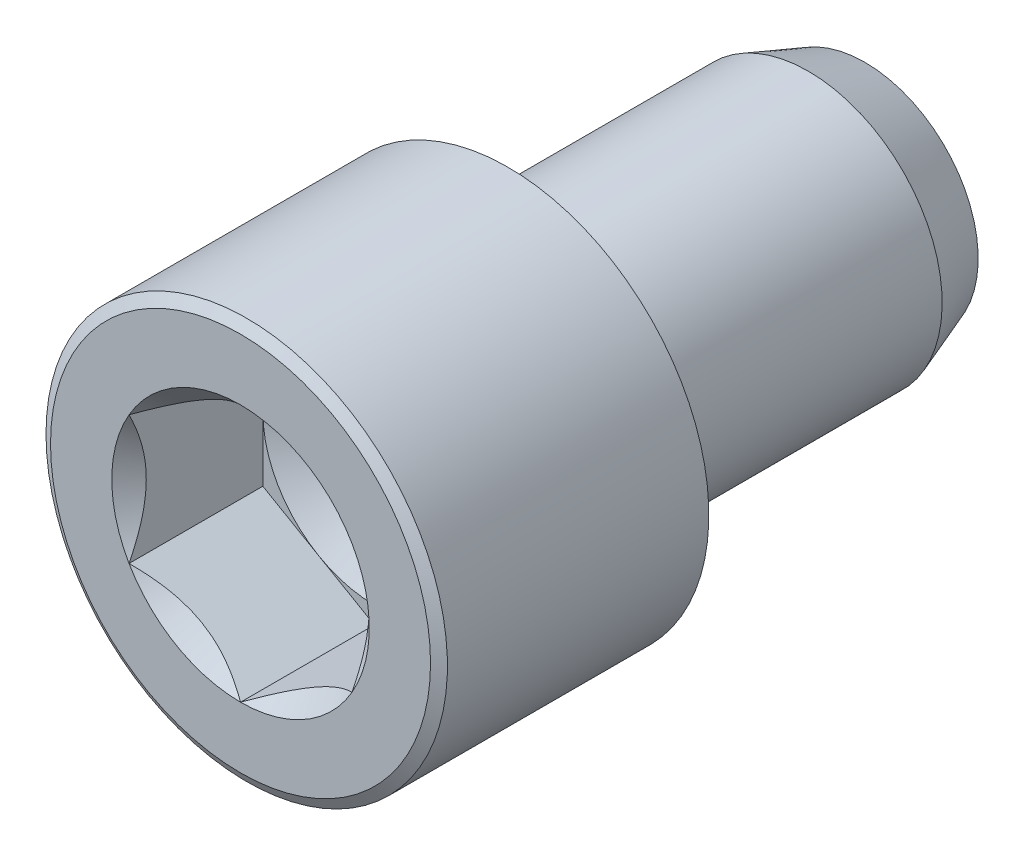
from build123d import *

# Parameters (mm, degrees)
SKETCH1_W          = 12.7
SKETCH1_H          = 4.7625
SKETCH4_R          = 7.14375
EXTRUDE1_DEPTH     = 9.525
CHAMFER1_SIZE      = 0.381
CHAMFER1_SIZE2     = 0.219970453
CUT_EXTRUDE1_DEPTH = 4.7625
SKETCH8_R          = 3.96875
CUT_EXTRUDE5_DEPTH = 1.5875
CUT_EXTRUDE5_DRAFT = -60


with BuildPart() as part:
    # Sketch1 → Revolve1 (revolve)
    with BuildSketch(Plane(origin=(0, 0, 0), x_dir=(0, 0, -1), z_dir=(1, 0, 0))):
        with Locations((6.35, 2.38125)):
            Rectangle(SKETCH1_W, SKETCH1_H)
    revolve(axis=Axis((0, 0, 0), (0, 0, 1)))

    # Sketch3 → Cut-Revolve2 (revolve, cut)
    with BuildSketch(Plane(origin=(0, 0, 0), x_dir=(0, 0, -1), z_dir=(1, 0, 0))):
        Polygon((12.7, 4.029111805), (10.685032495, 4.7625), (12.7, 4.7625), align=None)
    revolve(axis=Axis((0, 0, -10.685032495), (0, 0, 1)), mode=Mode.SUBTRACT)

    # Sketch4 → Extrude1 (add)
    with BuildSketch(Plane.XY):
        with Locations(Location((0, 0, 0), (0, 0, 180))):
            Circle(SKETCH4_R)
    extrude(amount=EXTRUDE1_DEPTH)

    # Chamfer1
    chamfer1_edges = [part.edges().sort_by_distance(p)[0] for p in [
        (7.14375, 0, 9.525),
    ]]
    chamfer1_side = [part.faces().sort_by_distance(p)[0] for p in [
        (0, 0, 9.525),
    ]]
    chamfer(chamfer1_edges, length=CHAMFER1_SIZE, length2=CHAMFER1_SIZE2, reference=chamfer1_side[0])

    # Sketch6 → Cut-Extrude1 (cut)
    with BuildSketch(Plane.XY.offset(9.525)):
        Polygon((0, -4.582717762), (3.96875, -2.291358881), (3.96875, 2.291358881), (0, 4.582717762), (-3.96875, 2.291358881), (-3.96875, -2.291358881), align=None)
    extrude(amount=-CUT_EXTRUDE1_DEPTH, mode=Mode.SUBTRACT)

    # Cut-Extrude4 cone 1 section (on through the dimple's axis) → Cut-Extrude4 (revolve, cut)
    with BuildSketch(Plane(origin=(0, 0, 9.525), x_dir=(0, -1, 0), z_dir=(1, 0, 0))):
        Polygon((0, 0), (4.582717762, 0), (0, 4.582717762), align=None)
    revolve(axis=Axis((0, 0, 9.525), (0, 0, -1)), mode=Mode.SUBTRACT)


with BuildPart() as cut_extrude5_tool:
    # Sketch8 → Cut-Extrude5 (with draft: the straight prism first)
    with BuildSketch(Plane.XY.offset(4.7625)):
        Circle(SKETCH8_R)
    extrude(amount=-CUT_EXTRUDE5_DEPTH)
    # Cut-Extrude5: the draft: its side faces are tilted about the plane it starts from
    cut_extrude5_sides = [cut_extrude5_tool.faces().sort_by_distance(p)[0] for p in [
        (-3.96875, 0, 3.96875),
    ]]
    draft(cut_extrude5_sides, Plane.XY.offset(4.7625), CUT_EXTRUDE5_DRAFT)


with BuildPart() as part_1:
    add(part.part)

    # Cut-Extrude5: cut by cut_extrude5_tool
    add(cut_extrude5_tool.part, mode=Mode.SUBTRACT)


solid = part_1.part
